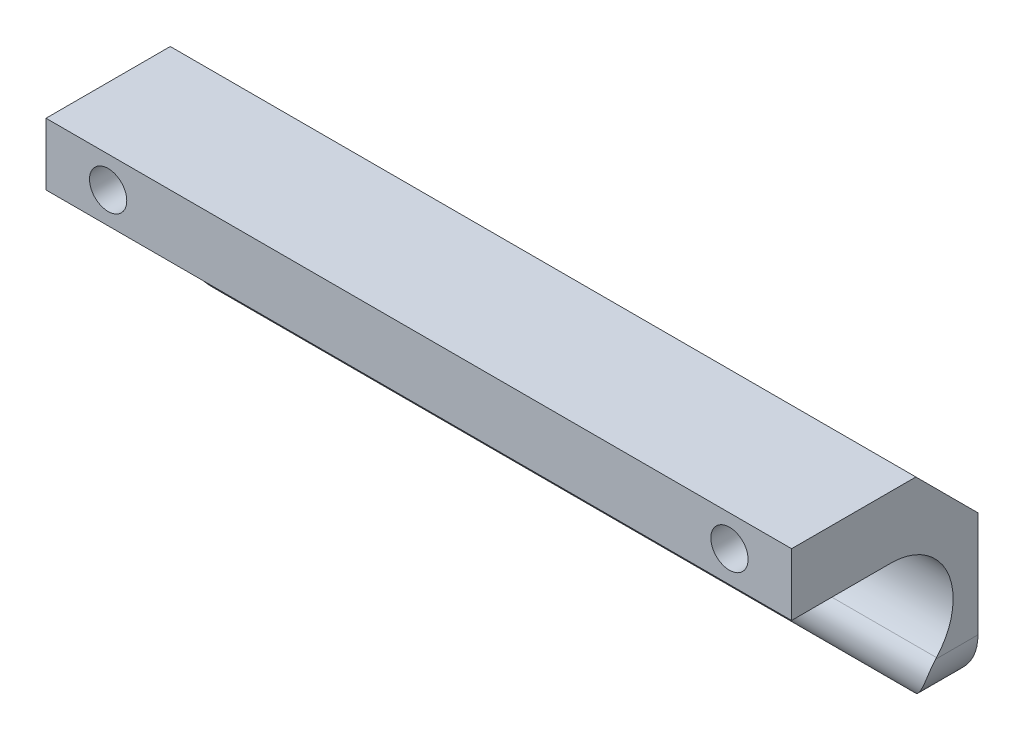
from build123d import *

# Parameters (mm, degrees)
SKETCH1_W      = 30
SKETCH1_H      = 35
EXTRUDE1_DEPTH = 60
CHAMFER1_SIZE  = 10
EXTRUDE2_DEPTH = 120
EXTRUDE3_DEPTH = 70.327123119


with BuildPart() as part:
    # Sketch1 → Extrude1 (new, symmetric)
    with BuildSketch(Plane(origin=(0, 0, 0), x_dir=(0, 0, -1), z_dir=(1, 0, 0))):
        Rectangle(SKETCH1_W, SKETCH1_H)
    extrude(amount=EXTRUDE1_DEPTH, both=True)

    # Chamfer1
    chamfer1_edges = [part.edges().sort_by_distance(p)[0] for p in [
        (0, 17.5, -15),
    ]]
    chamfer(chamfer1_edges, length=CHAMFER1_SIZE)

    # Sketch2 → Extrude2 (cut)
    with BuildSketch(Plane(origin=(60, 0, 0), x_dir=(0, 0, -1), z_dir=(1, 0, 0))):
        with BuildLine():
            ThreePointArc((8.30782305, -9.326105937), (10.172269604, 1.483650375), (1, 7.5))
            Line((1, 7.5), (-15, 7.5))
            Line((-15, 7.5), (-15, -17.5))
            Line((-15, -17.5), (11.857864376, -17.5))
            ThreePointArc((11.857864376, -17.5), (7.4021002, -14.577338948), (8.30782305, -9.326105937))
        make_face()
        with BuildLine():
            ThreePointArc((15, -16.346974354), (13.531370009, -17.202642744), (11.857864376, -17.5))
            Line((11.857864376, -17.5), (15, -17.5))
            Line((15, -17.5), (15, -16.346974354))
        make_face()
    extrude(amount=-EXTRUDE2_DEPTH, mode=Mode.SUBTRACT)

    # Sketch3 → Extrude3 (cut, through all)
    with BuildSketch(Plane(origin=(0, 0, -15), x_dir=(-1, 0, 0), z_dir=(0, 0, -1))):
        with BuildLine():
            Line((-60, -17.5), (-60, -9.5))
            ThreePointArc((-60, -9.5), (-57.656854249, -15.156854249), (-52, -17.5))
            Line((-52, -17.5), (-60, -17.5))
        make_face()
        with BuildLine():
            Line((60, -17.5), (60, -9.5))
            ThreePointArc((60, -9.5), (57.656854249, -15.156854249), (52, -17.5))
            Line((52, -17.5), (60, -17.5))
        make_face()
    extrude(amount=-EXTRUDE3_DEPTH, mode=Mode.SUBTRACT)

    # Sketch4 → M6x1.0 Tapped Hole1 (revolve, cut)
    with BuildSketch(Plane(origin=(-50, 12.5, 15), x_dir=(0, -1, 0), z_dir=(1, 0, 0))):
        Polygon((0, 0), (0, 18.502151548), (2.5, 17), (2.5, 12), (3, 12), (3, 0), align=None)
    m6x1_0_tapped_hole1 = revolve(axis=Axis((-50, 12.5, 21.35), (0, 0, -1)), mode=Mode.SUBTRACT)

    # Mirror1: M6x1.0 Tapped Hole1 across plane
    add(m6x1_0_tapped_hole1.mirror(Plane(origin=(0, 0, 0), x_dir=(0, 0, 1), z_dir=(1, 0, 0))), mode=Mode.SUBTRACT)


solid = part.part
